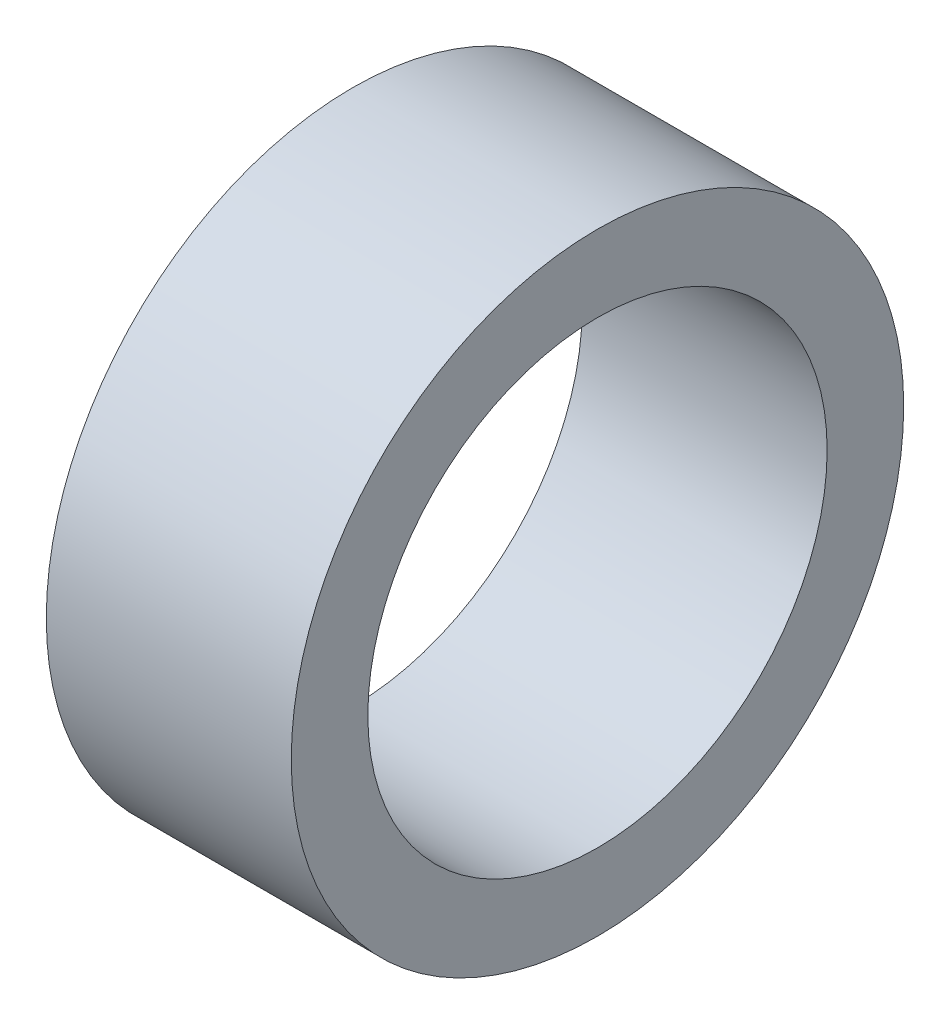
from build123d import *

# Parameters (mm, degrees)
ESQUISSE1_W = 8
ESQUISSE1_H = 2.5


with BuildPart() as part:
    # Esquisse1 → Base-R_volution (revolve)
    with BuildSketch(Plane.XY, mode=Mode.PRIVATE) as base_r_volution_sk:
        with Locations((4, 8.75)):
            Rectangle(ESQUISSE1_W, ESQUISSE1_H)
    revolve(base_r_volution_sk.sketch.rotate(Axis((0, 0, 0), (1, 0, 0)), 90), axis=Axis((0, 0, 0), (1, 0, 0)))


solid = part.part
